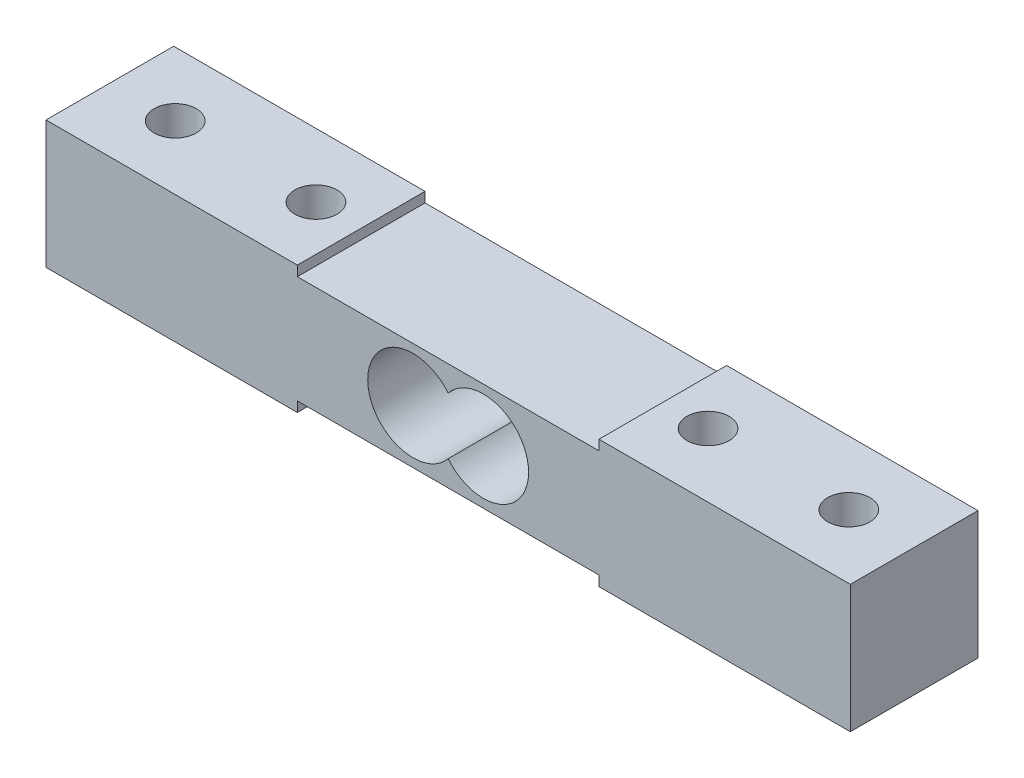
from build123d import *

# Parameters (mm, degrees)
SKETCH1_W             = 80
SKETCH1_H             = 12.7
BOSS_EXTRUDE1_DEPTH   = 12.7
M5X0_8_TAPPED_HOLE1_D = 4.2
SKETCH4_W             = 30
SKETCH4_H             = 12.7
CUT_EXTRUDE1_DEPTH    = 1
SKETCH5_R             = 4.5
CUT_EXTRUDE2_DEPTH    = 44.847234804


with BuildPart() as part:
    # Sketch1 → Boss-Extrude1 (new body)
    with BuildSketch(Plane(origin=(0, 0, 0), x_dir=(1, 0, 0), z_dir=(0, 1, 0))):
        Rectangle(SKETCH1_W, SKETCH1_H)
    extrude(amount=BOSS_EXTRUDE1_DEPTH)

    # M5x0.8 Tapped Hole1 (through all)
    with Locations(Plane(origin=(0, 12.7, 0), x_dir=(1, 0, 0), z_dir=(0, 1, 0))):
        with Locations((-33.5, 0), (-19.5, 0)):
            m5x0_8_tapped_hole1 = Hole(M5X0_8_TAPPED_HOLE1_D / 2)

    # Mirror1: M5x0.8 Tapped Hole1 across plane
    add(m5x0_8_tapped_hole1.mirror(Plane(origin=(0, 0, 0), x_dir=(0, 0, 1), z_dir=(1, 0, 0))), mode=Mode.SUBTRACT)

    # Sketch4 → Cut-Extrude1 (cut)
    with BuildSketch(Plane(origin=(0, 12.7, 0), x_dir=(1, 0, 0), z_dir=(0, 1, 0))):
        Rectangle(SKETCH4_W, SKETCH4_H)
    cut_extrude1 = extrude(amount=-CUT_EXTRUDE1_DEPTH, mode=Mode.SUBTRACT)

    # Mirror3: Cut-Extrude1 across plane
    add(cut_extrude1.mirror(Plane.ZX.offset(6.35)), mode=Mode.SUBTRACT)

    # Sketch5 → Cut-Extrude2 (cut, through all)
    with BuildSketch(Plane.XY.offset(6.35)):
        with Locations((3.5, 6.35)):
            Circle(SKETCH5_R)
        with Locations((-3.5, 6.35)):
            Circle(SKETCH5_R)
    extrude(amount=-CUT_EXTRUDE2_DEPTH, mode=Mode.SUBTRACT)


solid = part.part
